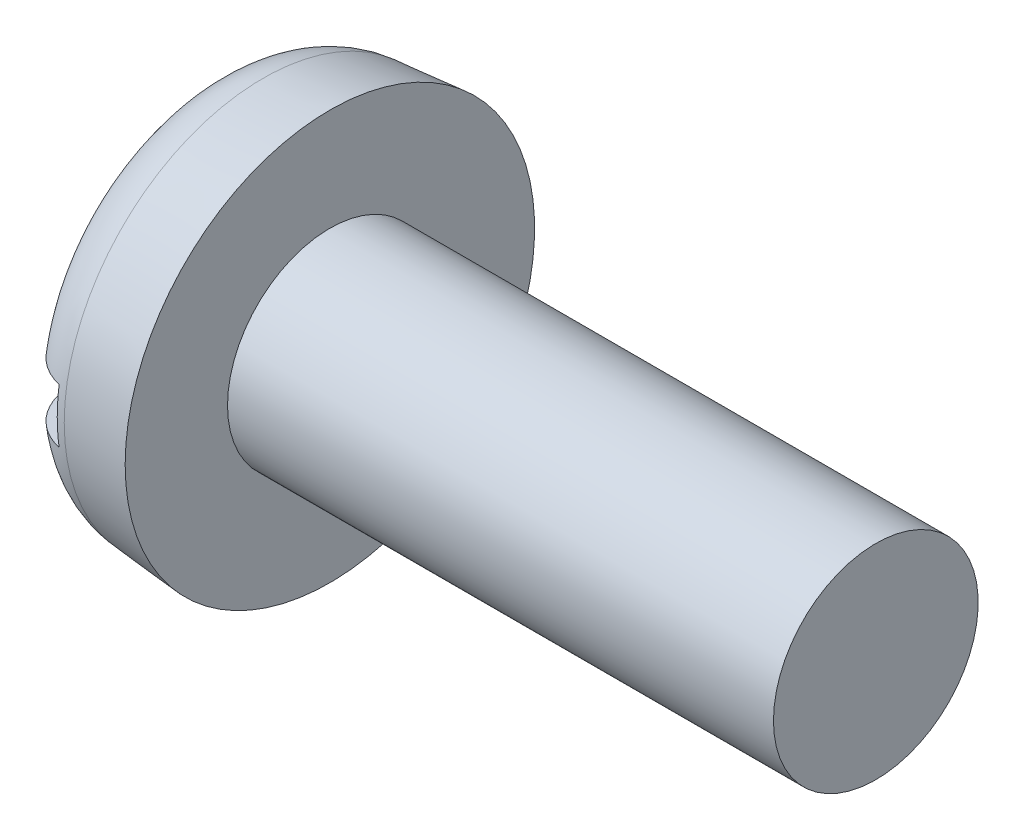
ISO-10303-21;
HEADER;
FILE_DESCRIPTION(('STEP AP214'),'2;1');
FILE_NAME('part.step','',(''),(''),'','','');
FILE_SCHEMA(('AUTOMOTIVE_DESIGN { 1 0 10303 214 1 1 1 1 }'));
ENDSEC;
DATA;
#1=APPLICATION_CONTEXT('core data for automotive mechanical design processes');
#2=APPLICATION_PROTOCOL_DEFINITION('international standard','automotive_design',2000,#1);
#3=PRODUCT_CONTEXT('',#1,'mechanical');
#4=PRODUCT('Part','Part','',(#3));
#5=PRODUCT_RELATED_PRODUCT_CATEGORY('part','',(#4));
#6=PRODUCT_DEFINITION_FORMATION('','',#4);
#7=PRODUCT_DEFINITION_CONTEXT('part definition',#1,'design');
#8=PRODUCT_DEFINITION('design','',#6,#7);
#9=PRODUCT_DEFINITION_SHAPE('','',#8);
#10=(LENGTH_UNIT() NAMED_UNIT(*) SI_UNIT(.MILLI.,.METRE.));
#11=(NAMED_UNIT(*) PLANE_ANGLE_UNIT() SI_UNIT($,.RADIAN.));
#12=(NAMED_UNIT(*) SI_UNIT($,.STERADIAN.) SOLID_ANGLE_UNIT());
#13=UNCERTAINTY_MEASURE_WITH_UNIT(LENGTH_MEASURE(1.E-05),#10,'distance_accuracy_value','');
#14=(GEOMETRIC_REPRESENTATION_CONTEXT(3) GLOBAL_UNCERTAINTY_ASSIGNED_CONTEXT((#13)) GLOBAL_UNIT_ASSIGNED_CONTEXT((#10,
#11,#12)) REPRESENTATION_CONTEXT('',''));
#15=CARTESIAN_POINT('',(0.,0.,0.));
#16=DIRECTION('',(0.,0.,1.));
#17=DIRECTION('',(1.,0.,0.));
#18=AXIS2_PLACEMENT_3D('',#15,#16,#17);
#19=CARTESIAN_POINT('',(0.,0.,0.));
#20=DIRECTION('',(-1.,0.,0.));
#21=DIRECTION('',(0.,0.,1.));
#22=AXIS2_PLACEMENT_3D('',#19,#20,#21);
#23=PLANE('',#22);
#24=DIRECTION('',(0.,0.,-1.));
#25=VECTOR('',#24,1.);
#26=CARTESIAN_POINT('',(0.,0.799999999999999,6.));
#27=LINE('',#26,#25);
#28=CARTESIAN_POINT('',(0.,0.799999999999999,3.9555566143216));
#29=VERTEX_POINT('',#28);
#30=CARTESIAN_POINT('',(0.,0.799999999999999,-3.9555566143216));
#31=VERTEX_POINT('',#30);
#32=EDGE_CURVE('E88',#29,#31,#27,.T.);
#33=ORIENTED_EDGE('',*,*,#32,.F.);
#34=CARTESIAN_POINT('',(0.,0.,0.));
#35=DIRECTION('',(-1.,0.,0.));
#36=DIRECTION('',(0.,0.,1.));
#37=AXIS2_PLACEMENT_3D('',#34,#35,#36);
#38=CIRCLE('',#37,4.03564469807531);
#39=EDGE_CURVE('E94',#29,#31,#38,.T.);
#40=ORIENTED_EDGE('',*,*,#39,.T.);
#41=EDGE_LOOP('',(#33,#40));
#42=FACE_BOUND('',#41,.T.);
#43=ADVANCED_FACE('F35',(#42),#23,.T.);
#44=CARTESIAN_POINT('',(-25.4,0.,0.));
#45=DIRECTION('',(-1.,0.,0.));
#46=DIRECTION('',(0.,0.,1.));
#47=AXIS2_PLACEMENT_3D('',#44,#45,#46);
#48=CYLINDRICAL_SURFACE('',#47,3.);
#49=CARTESIAN_POINT('',(19.6,0.,0.));
#50=DIRECTION('',(-1.,0.,0.));
#51=DIRECTION('',(0.,0.,1.));
#52=AXIS2_PLACEMENT_3D('',#49,#50,#51);
#53=CIRCLE('',#52,3.);
#54=CARTESIAN_POINT('',(19.6,0.,3.));
#55=VERTEX_POINT('',#54);
#56=EDGE_CURVE('E95',#55,#55,#53,.T.);
#57=ORIENTED_EDGE('',*,*,#56,.T.);
#58=EDGE_LOOP('',(#57));
#59=FACE_BOUND('',#58,.T.);
#60=CARTESIAN_POINT('',(3.6,0.,0.));
#61=DIRECTION('',(-1.,0.,0.));
#62=DIRECTION('',(0.,0.,1.));
#63=AXIS2_PLACEMENT_3D('',#60,#61,#62);
#64=CIRCLE('',#63,3.);
#65=CARTESIAN_POINT('',(3.6,0.,3.));
#66=VERTEX_POINT('',#65);
#67=EDGE_CURVE('E152',#66,#66,#64,.T.);
#68=ORIENTED_EDGE('',*,*,#67,.F.);
#69=EDGE_LOOP('',(#68));
#70=FACE_BOUND('',#69,.T.);
#71=ADVANCED_FACE('F140',(#59,#70),#48,.T.);
#72=CARTESIAN_POINT('',(19.6,3.,0.));
#73=DIRECTION('',(1.,0.,0.));
#74=DIRECTION('',(0.,0.,-1.));
#75=AXIS2_PLACEMENT_3D('',#72,#73,#74);
#76=PLANE('',#75);
#77=ORIENTED_EDGE('',*,*,#56,.F.);
#78=EDGE_LOOP('',(#77));
#79=FACE_BOUND('',#78,.T.);
#80=ADVANCED_FACE('F138',(#79),#76,.T.);
#81=DIRECTION('',(0.,0.,1.));
#82=VECTOR('',#81,1.);
#83=CARTESIAN_POINT('',(0.,-0.799999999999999,-6.));
#84=LINE('',#83,#82);
#85=CARTESIAN_POINT('',(0.,-0.799999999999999,-3.9555566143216));
#86=VERTEX_POINT('',#85);
#87=CARTESIAN_POINT('',(0.,-0.800000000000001,3.9555566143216));
#88=VERTEX_POINT('',#87);
#89=EDGE_CURVE('E79',#86,#88,#84,.T.);
#90=ORIENTED_EDGE('',*,*,#89,.F.);
#91=EDGE_CURVE('E86',#86,#88,#38,.T.);
#92=ORIENTED_EDGE('',*,*,#91,.T.);
#93=EDGE_LOOP('',(#90,#92));
#94=FACE_BOUND('',#93,.T.);
#95=ADVANCED_FACE('F85',(#94),#23,.T.);
#96=CARTESIAN_POINT('',(0.,0.,0.));
#97=DIRECTION('',(1.,0.,0.));
#98=DIRECTION('',(0.,0.,-1.));
#99=AXIS2_PLACEMENT_3D('',#96,#97,#98);
#100=CONICAL_SURFACE('',#99,5.68504081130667,0.0872664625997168);
#101=CARTESIAN_POINT('',(1.64311966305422,0.,0.));
#102=DIRECTION('',(-1.,0.,0.));
#103=DIRECTION('',(0.,0.,1.));
#104=AXIS2_PLACEMENT_3D('',#101,#102,#103);
#105=CIRCLE('',#104,5.82879515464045);
#106=CARTESIAN_POINT('',(1.64311966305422,0.,5.82879515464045));
#107=VERTEX_POINT('',#106);
#108=EDGE_CURVE('E98',#107,#107,#105,.F.);
#109=ORIENTED_EDGE('',*,*,#108,.T.);
#110=EDGE_LOOP('',(#109));
#111=FACE_BOUND('',#110,.T.);
#112=CARTESIAN_POINT('',(3.6,0.,0.));
#113=DIRECTION('',(-1.,0.,0.));
#114=DIRECTION('',(0.,0.,1.));
#115=AXIS2_PLACEMENT_3D('',#112,#113,#114);
#116=CIRCLE('',#115,6.);
#117=CARTESIAN_POINT('',(3.6,0.,6.));
#118=VERTEX_POINT('',#117);
#119=EDGE_CURVE('E100',#118,#118,#116,.T.);
#120=ORIENTED_EDGE('',*,*,#119,.T.);
#121=EDGE_LOOP('',(#120));
#122=FACE_BOUND('',#121,.T.);
#123=ADVANCED_FACE('F131',(#111,#122),#100,.T.);
#124=CARTESIAN_POINT('',(3.6,3.,0.));
#125=DIRECTION('',(-1.,0.,0.));
#126=DIRECTION('',(0.,0.,1.));
#127=AXIS2_PLACEMENT_3D('',#124,#125,#126);
#128=PLANE('',#127);
#129=ORIENTED_EDGE('',*,*,#119,.F.);
#130=EDGE_LOOP('',(#129));
#131=FACE_BOUND('',#130,.T.);
#132=ORIENTED_EDGE('',*,*,#67,.T.);
#133=EDGE_LOOP('',(#132));
#134=FACE_BOUND('',#133,.T.);
#135=ADVANCED_FACE('F127',(#131,#134),#128,.F.);
#136=CARTESIAN_POINT('',(1.8,0.,0.));
#137=DIRECTION('',(-1.,0.,0.));
#138=DIRECTION('',(0.,0.,1.));
#139=AXIS2_PLACEMENT_3D('',#136,#137,#138);
#140=TOROIDAL_SURFACE('',#139,4.03564469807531,1.8);
#141=CARTESIAN_POINT('',(0.540762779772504,0.799999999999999,-5.2613759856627));
#142=CARTESIAN_POINT('',(0.612348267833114,0.799999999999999,-5.33226007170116));
#143=CARTESIAN_POINT('',(0.689931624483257,0.799999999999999,-5.3971854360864));
#144=CARTESIAN_POINT('',(0.854947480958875,0.799999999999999,-5.51316161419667));
#145=CARTESIAN_POINT('',(0.94239068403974,0.799999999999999,-5.56419714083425));
#146=CARTESIAN_POINT('',(1.12461220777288,0.799999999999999,-5.650821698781));
#147=CARTESIAN_POINT('',(1.21938917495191,0.799999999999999,-5.6864135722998));
#148=CARTESIAN_POINT('',(1.41356630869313,0.799999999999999,-5.74109194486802));
#149=CARTESIAN_POINT('',(1.51296538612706,0.799999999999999,-5.76018231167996));
#150=CARTESIAN_POINT('',(1.71313899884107,0.799999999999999,-5.78126121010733));
#151=CARTESIAN_POINT('',(1.81390602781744,0.799999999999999,-5.78332104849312));
#152=CARTESIAN_POINT('',(2.01435310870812,0.799999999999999,-5.77046455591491));
#153=CARTESIAN_POINT('',(2.11403314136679,0.799999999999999,-5.75554792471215));
#154=CARTESIAN_POINT('',(2.309314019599,0.799999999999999,-5.70921606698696));
#155=CARTESIAN_POINT('',(2.40492104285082,0.799999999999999,-5.67782686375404));
#156=CARTESIAN_POINT('',(2.58952927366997,0.799999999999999,-5.59948776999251));
#157=CARTESIAN_POINT('',(2.67853045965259,0.799999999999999,-5.55253782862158));
#158=CARTESIAN_POINT('',(2.84769451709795,0.799999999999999,-5.44428887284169));
#159=CARTESIAN_POINT('',(2.92783091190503,0.799999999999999,-5.38294849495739));
#160=CARTESIAN_POINT('',(3.07676159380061,0.799999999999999,-5.24777626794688));
#161=CARTESIAN_POINT('',(3.1455556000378,0.799999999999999,-5.17394410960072));
#162=CARTESIAN_POINT('',(3.27042510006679,0.799999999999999,-5.01531035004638));
#163=CARTESIAN_POINT('',(3.32640120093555,0.799999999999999,-4.93043053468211));
#164=CARTESIAN_POINT('',(3.4235057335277,0.799999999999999,-4.75256933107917));
#165=CARTESIAN_POINT('',(3.46463341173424,0.799999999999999,-4.65958753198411));
#166=CARTESIAN_POINT('',(3.53144158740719,0.799999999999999,-4.46694835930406));
#167=CARTESIAN_POINT('',(3.55692557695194,0.799999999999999,-4.36722286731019));
#168=CARTESIAN_POINT('',(3.59108701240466,0.799999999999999,-4.16493761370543));
#169=CARTESIAN_POINT('',(3.59976314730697,0.799999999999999,-4.06237763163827));
#170=CARTESIAN_POINT('',(3.60023112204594,0.799999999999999,-3.85550711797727));
#171=CARTESIAN_POINT('',(3.59173848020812,0.799999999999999,-3.75119596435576));
#172=CARTESIAN_POINT('',(3.55768438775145,0.799999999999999,-3.54539907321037));
#173=CARTESIAN_POINT('',(3.53212117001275,0.799999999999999,-3.44391362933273));
#174=CARTESIAN_POINT('',(3.46412322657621,0.799999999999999,-3.24471369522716));
#175=CARTESIAN_POINT('',(3.42139292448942,0.799999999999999,-3.14710004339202));
#176=CARTESIAN_POINT('',(3.32030286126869,0.799999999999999,-2.96031799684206));
#177=CARTESIAN_POINT('',(3.26194098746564,0.799999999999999,-2.87115074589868));
#178=CARTESIAN_POINT('',(3.13053846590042,0.799999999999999,-2.70303664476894));
#179=CARTESIAN_POINT('',(3.05736818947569,0.799999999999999,-2.62419095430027));
#180=CARTESIAN_POINT('',(2.89859048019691,0.799999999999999,-2.48017518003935));
#181=CARTESIAN_POINT('',(2.81298317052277,0.799999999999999,-2.41500496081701));
#182=CARTESIAN_POINT('',(2.6334271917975,0.799999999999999,-2.30187272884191));
#183=CARTESIAN_POINT('',(2.53967929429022,0.799999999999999,-2.25359299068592));
#184=CARTESIAN_POINT('',(2.34507363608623,0.799999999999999,-2.17455467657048));
#185=CARTESIAN_POINT('',(2.24421969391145,0.799999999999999,-2.14378676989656));
#186=CARTESIAN_POINT('',(2.04443930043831,0.799999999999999,-2.10254396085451));
#187=CARTESIAN_POINT('',(1.94573097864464,0.799999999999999,-2.09101175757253));
#188=CARTESIAN_POINT('',(1.74783816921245,0.799999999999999,-2.08550669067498));
#189=CARTESIAN_POINT('',(1.64865381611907,0.799999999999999,-2.09152912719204));
#190=CARTESIAN_POINT('',(1.45702700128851,0.799999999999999,-2.12018138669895));
#191=CARTESIAN_POINT('',(1.36447664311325,0.799999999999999,-2.14209986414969));
#192=CARTESIAN_POINT('',(1.18420660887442,0.799999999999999,-2.20075771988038));
#193=CARTESIAN_POINT('',(1.09648771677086,0.799999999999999,-2.23749949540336));
#194=CARTESIAN_POINT('',(0.925723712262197,0.799999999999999,-2.32557805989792));
#195=CARTESIAN_POINT('',(0.842868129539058,0.799999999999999,-2.37728131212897));
#196=CARTESIAN_POINT('',(0.686362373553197,0.799999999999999,-2.493116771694));
#197=CARTESIAN_POINT('',(0.612714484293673,0.799999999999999,-2.55725205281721));
#198=CARTESIAN_POINT('',(0.472161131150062,0.799999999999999,-2.70027682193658));
#199=CARTESIAN_POINT('',(0.405916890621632,0.799999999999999,-2.77981681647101));
#200=CARTESIAN_POINT('',(0.287173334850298,0.799999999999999,-2.9485732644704));
#201=CARTESIAN_POINT('',(0.234676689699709,0.799999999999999,-3.03779159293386));
#202=CARTESIAN_POINT('',(0.143214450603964,0.799999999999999,-3.22677844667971));
#203=CARTESIAN_POINT('',(0.104782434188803,0.799999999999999,-3.32680584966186));
#204=CARTESIAN_POINT('',(0.0452446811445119,0.799999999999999,-3.5318922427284));
#205=CARTESIAN_POINT('',(0.0241387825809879,0.799999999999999,-3.63695118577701));
#206=CARTESIAN_POINT('',(-1.12670491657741E-05,0.799999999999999,-3.84916824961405));
#207=CARTESIAN_POINT('',(-0.00304965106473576,0.799999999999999,-3.95632702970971));
#208=CARTESIAN_POINT('',(0.00921984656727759,0.799999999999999,-4.16962319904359));
#209=CARTESIAN_POINT('',(0.0245310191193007,0.799999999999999,-4.27576040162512));
#210=CARTESIAN_POINT('',(0.0728327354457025,0.799999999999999,-4.48216521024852));
#211=CARTESIAN_POINT('',(0.105541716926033,0.799999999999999,-4.58249883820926));
#212=CARTESIAN_POINT('',(0.187634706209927,0.799999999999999,-4.77599767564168));
#213=CARTESIAN_POINT('',(0.236996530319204,0.799999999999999,-4.86917222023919));
#214=CARTESIAN_POINT('',(0.329466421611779,0.799999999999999,-5.01228034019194));
#215=CARTESIAN_POINT('',(0.367921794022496,0.799999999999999,-5.06527765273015));
#216=CARTESIAN_POINT('',(0.450329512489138,0.799999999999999,-5.16681267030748));
#217=CARTESIAN_POINT('',(0.494281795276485,0.799999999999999,-5.21535042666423));
#218=CARTESIAN_POINT('',(0.540762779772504,0.799999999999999,-5.2613759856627));
#219=B_SPLINE_CURVE_WITH_KNOTS('',3,(#141,#142,#143,#144,#145,#146,#147,#148,#149,#150,#151,
#152,#153,#154,#155,#156,#157,#158,#159,#160,#161,#162,#163,#164,#165,#166,#167,#168,#169,#170,
#171,#172,#173,#174,#175,#176,#177,#178,#179,#180,#181,#182,#183,#184,#185,#186,#187,#188,#189,
#190,#191,#192,#193,#194,#195,#196,#197,#198,#199,#200,#201,#202,#203,#204,#205,#206,#207,#208,
#209,#210,#211,#212,#213,#214,#215,#216,#217,#218),.UNSPECIFIED.,.T.,.F.,(4,2,2,2,2,2,2,2,2,2,2,
2,2,2,2,2,2,2,2,2,2,2,2,2,2,2,2,2,2,2,2,2,2,2,2,2,2,2,4),(0.,0.301990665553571,
0.604312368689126,0.906578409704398,1.20877358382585,1.50970282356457,1.81063738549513,
2.11109795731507,2.41155951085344,2.71289551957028,3.01423898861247,3.31784547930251,
3.6214673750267,3.92882908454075,4.23621476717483,4.54873547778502,4.86128854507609,
5.17947093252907,5.49769634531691,5.81883829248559,6.13997705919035,6.45470120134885,
6.76925749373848,7.06587349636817,7.36241009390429,7.64643650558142,7.93050886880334,
8.22223277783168,8.51402890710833,8.8231740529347,9.13237919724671,9.45232886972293,
9.77227555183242,10.0923243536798,10.4124305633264,10.7275071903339,11.042165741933,
11.2382527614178,11.4343375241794),.UNSPECIFIED.);
#220=CARTESIAN_POINT('',(1.4,0.799999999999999,-5.73510972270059));
#221=VERTEX_POINT('',#220);
#222=EDGE_CURVE('E11',#31,#221,#219,.T.);
#223=ORIENTED_EDGE('',*,*,#222,.F.);
#224=ORIENTED_EDGE('',*,*,#39,.F.);
#225=CARTESIAN_POINT('',(0.836266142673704,0.799999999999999,2.3847675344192));
#226=CARTESIAN_POINT('',(0.917616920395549,0.799999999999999,2.33037611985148));
#227=CARTESIAN_POINT('',(1.00338812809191,0.799999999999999,2.28250940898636));
#228=CARTESIAN_POINT('',(1.18171371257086,0.799999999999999,2.20157945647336));
#229=CARTESIAN_POINT('',(1.27427138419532,0.799999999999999,2.16852346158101));
#230=CARTESIAN_POINT('',(1.46387360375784,0.799999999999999,2.11861651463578));
#231=CARTESIAN_POINT('',(1.56092620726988,0.799999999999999,2.10179593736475));
#232=CARTESIAN_POINT('',(1.75645828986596,0.799999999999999,2.08531619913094));
#233=CARTESIAN_POINT('',(1.85493729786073,0.799999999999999,2.08565149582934));
#234=CARTESIAN_POINT('',(2.04724581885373,0.799999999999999,2.10316628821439));
#235=CARTESIAN_POINT('',(2.1411242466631,0.799999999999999,2.11981673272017));
#236=CARTESIAN_POINT('',(2.32483197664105,0.799999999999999,2.16840533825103));
#237=CARTESIAN_POINT('',(2.41466058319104,0.799999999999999,2.20034611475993));
#238=CARTESIAN_POINT('',(2.58937479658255,0.799999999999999,2.27883470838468));
#239=CARTESIAN_POINT('',(2.67416016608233,0.799999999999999,2.32560484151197));
#240=CARTESIAN_POINT('',(2.83527159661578,0.799999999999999,2.43194790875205));
#241=CARTESIAN_POINT('',(2.91159566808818,0.799999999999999,2.4915238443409));
#242=CARTESIAN_POINT('',(3.05833847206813,0.799999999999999,2.62557742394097));
#243=CARTESIAN_POINT('',(3.12814463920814,0.799999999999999,2.70072607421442));
#244=CARTESIAN_POINT('',(3.25476371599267,0.799999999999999,2.86127427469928));
#245=CARTESIAN_POINT('',(3.31157384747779,0.799999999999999,2.94667601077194));
#246=CARTESIAN_POINT('',(3.41282909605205,0.799999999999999,3.12914373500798));
#247=CARTESIAN_POINT('',(3.4566732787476,0.799999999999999,3.22654397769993));
#248=CARTESIAN_POINT('',(3.52749042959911,0.799999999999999,3.42730182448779));
#249=CARTESIAN_POINT('',(3.55446245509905,0.799999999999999,3.53065976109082));
#250=CARTESIAN_POINT('',(3.59074777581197,0.799999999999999,3.74099682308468));
#251=CARTESIAN_POINT('',(3.59996828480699,0.799999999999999,3.84799201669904));
#252=CARTESIAN_POINT('',(3.60003154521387,0.799999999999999,4.06199242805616));
#253=CARTESIAN_POINT('',(3.59087543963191,0.799999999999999,4.16899764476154));
#254=CARTESIAN_POINT('',(3.5545508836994,0.799999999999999,4.37828946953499));
#255=CARTESIAN_POINT('',(3.5276490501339,0.799999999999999,4.48062230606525));
#256=CARTESIAN_POINT('',(3.45672417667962,0.799999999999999,4.67917518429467));
#257=CARTESIAN_POINT('',(3.41270279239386,0.799999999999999,4.77539581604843));
#258=CARTESIAN_POINT('',(3.30967441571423,0.799999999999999,4.95711293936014));
#259=CARTESIAN_POINT('',(3.2509575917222,0.799999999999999,5.04277397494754));
#260=CARTESIAN_POINT('',(3.11977209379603,0.799999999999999,5.20282644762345));
#261=CARTESIAN_POINT('',(3.04730458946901,0.799999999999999,5.27721884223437));
#262=CARTESIAN_POINT('',(2.89186263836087,0.799999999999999,5.41145672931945));
#263=CARTESIAN_POINT('',(2.80906226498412,0.799999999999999,5.47150384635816));
#264=CARTESIAN_POINT('',(2.63447307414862,0.799999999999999,5.57667826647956));
#265=CARTESIAN_POINT('',(2.54268479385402,0.799999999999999,5.62180646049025));
#266=CARTESIAN_POINT('',(2.35372245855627,0.799999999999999,5.69541178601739));
#267=CARTESIAN_POINT('',(2.25661170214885,0.799999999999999,5.72405148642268));
#268=CARTESIAN_POINT('',(2.05894963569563,0.799999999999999,5.76452632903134));
#269=CARTESIAN_POINT('',(1.95839844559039,0.799999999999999,5.77636205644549));
#270=CARTESIAN_POINT('',(1.75726466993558,0.799999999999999,5.78286013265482));
#271=CARTESIAN_POINT('',(1.65668492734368,0.799999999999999,5.77761084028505));
#272=CARTESIAN_POINT('',(1.45783846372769,0.799999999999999,5.75028865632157));
#273=CARTESIAN_POINT('',(1.35957171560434,0.799999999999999,5.72821596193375));
#274=CARTESIAN_POINT('',(1.16819371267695,0.799999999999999,5.66791633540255));
#275=CARTESIAN_POINT('',(1.07507939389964,0.799999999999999,5.62969912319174));
#276=CARTESIAN_POINT('',(0.896555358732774,0.799999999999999,5.53823241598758));
#277=CARTESIAN_POINT('',(0.811145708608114,0.799999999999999,5.4849827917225));
#278=CARTESIAN_POINT('',(0.650082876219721,0.799999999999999,5.36476593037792));
#279=CARTESIAN_POINT('',(0.574468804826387,0.799999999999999,5.29774630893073));
#280=CARTESIAN_POINT('',(0.435451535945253,0.799999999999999,5.15205983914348));
#281=CARTESIAN_POINT('',(0.372048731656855,0.799999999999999,5.07339261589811));
#282=CARTESIAN_POINT('',(0.258650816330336,0.799999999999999,4.90594446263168));
#283=CARTESIAN_POINT('',(0.208774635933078,0.799999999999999,4.81708301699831));
#284=CARTESIAN_POINT('',(0.124428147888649,0.799999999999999,4.63233098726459));
#285=CARTESIAN_POINT('',(0.0899587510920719,0.799999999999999,4.53643998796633));
#286=CARTESIAN_POINT('',(0.0368868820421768,0.799999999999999,4.33899079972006));
#287=CARTESIAN_POINT('',(0.0185025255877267,0.799999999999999,4.23737401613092));
#288=CARTESIAN_POINT('',(-0.00125734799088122,0.799999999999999,4.03250747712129));
#289=CARTESIAN_POINT('',(-0.00263209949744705,0.799999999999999,3.9292576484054));
#290=CARTESIAN_POINT('',(0.0116307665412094,0.799999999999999,3.72214563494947));
#291=CARTESIAN_POINT('',(0.0275632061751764,0.799999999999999,3.61830377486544));
#292=CARTESIAN_POINT('',(0.0763335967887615,0.799999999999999,3.41464106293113));
#293=CARTESIAN_POINT('',(0.10917724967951,0.799999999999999,3.31482157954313));
#294=CARTESIAN_POINT('',(0.191511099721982,0.799999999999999,3.12021092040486));
#295=CARTESIAN_POINT('',(0.241286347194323,0.799999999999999,3.02554040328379));
#296=CARTESIAN_POINT('',(0.355915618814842,0.799999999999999,2.8458978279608));
#297=CARTESIAN_POINT('',(0.420755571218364,0.799999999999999,2.76091682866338));
#298=CARTESIAN_POINT('',(0.543269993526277,0.799999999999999,2.62572980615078));
#299=CARTESIAN_POINT('',(0.597683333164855,0.799999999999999,2.57253239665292));
#300=CARTESIAN_POINT('',(0.712598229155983,0.799999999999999,2.4731680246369));
#301=CARTESIAN_POINT('',(0.773099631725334,0.799999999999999,2.42700088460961));
#302=CARTESIAN_POINT('',(0.836266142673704,0.799999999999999,2.3847675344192));
#303=B_SPLINE_CURVE_WITH_KNOTS('',3,(#225,#226,#227,#228,#229,#230,#231,#232,#233,#234,#235,
#236,#237,#238,#239,#240,#241,#242,#243,#244,#245,#246,#247,#248,#249,#250,#251,#252,#253,#254,
#255,#256,#257,#258,#259,#260,#261,#262,#263,#264,#265,#266,#267,#268,#269,#270,#271,#272,#273,
#274,#275,#276,#277,#278,#279,#280,#281,#282,#283,#284,#285,#286,#287,#288,#289,#290,#291,#292,
#293,#294,#295,#296,#297,#298,#299,#300,#301,#302),.UNSPECIFIED.,.T.,.F.,(4,2,2,2,2,2,2,2,2,2,2,
2,2,2,2,2,2,2,2,2,2,2,2,2,2,2,2,2,2,2,2,2,2,2,2,2,2,2,4),(0.,0.293321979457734,
0.586787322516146,0.880800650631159,1.17471899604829,1.45941156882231,1.74415285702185,
2.03338255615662,2.32268012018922,2.62901646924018,2.93541824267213,3.25435495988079,
3.57330949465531,3.89392670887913,4.21452398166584,4.53041098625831,4.84626744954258,
5.1563211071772,5.46634840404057,5.77172128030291,6.0770759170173,6.37936593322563,
6.6816454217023,6.98236409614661,7.2830792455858,7.5836136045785,7.88415054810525,
8.18585270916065,8.48756458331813,8.79184901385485,9.09615143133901,9.40451898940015,
9.71290042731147,10.0266186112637,10.3404426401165,10.6598354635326,10.9789311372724,
11.2066928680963,11.43444884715),.UNSPECIFIED.);
#304=CARTESIAN_POINT('',(1.4,0.799999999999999,5.73510972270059));
#305=VERTEX_POINT('',#304);
#306=EDGE_CURVE('E112',#305,#29,#303,.T.);
#307=ORIENTED_EDGE('',*,*,#306,.F.);
#308=CARTESIAN_POINT('',(1.4,0.,0.));
#309=DIRECTION('',(-1.,0.,0.));
#310=DIRECTION('',(0.,0.,1.));
#311=AXIS2_PLACEMENT_3D('',#308,#309,#310);
#312=CIRCLE('',#311,5.79063757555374);
#313=CARTESIAN_POINT('',(1.4,-0.800000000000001,5.73510972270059));
#314=VERTEX_POINT('',#313);
#315=EDGE_CURVE('E106',#305,#314,#312,.F.);
#316=ORIENTED_EDGE('',*,*,#315,.T.);
#317=CARTESIAN_POINT('',(0.836266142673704,-0.8,2.3847675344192));
#318=CARTESIAN_POINT('',(0.748506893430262,-0.8,2.44345191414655));
#319=CARTESIAN_POINT('',(0.665766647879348,-0.8,2.50981960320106));
#320=CARTESIAN_POINT('',(0.512551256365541,-0.8,2.65561376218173));
#321=CARTESIAN_POINT('',(0.442099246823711,-0.8,2.73506432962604));
#322=CARTESIAN_POINT('',(0.315475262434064,-0.8,2.90443495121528));
#323=CARTESIAN_POINT('',(0.259280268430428,-0.8,2.99433778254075));
#324=CARTESIAN_POINT('',(0.162548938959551,-0.8,3.18215299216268));
#325=CARTESIAN_POINT('',(0.122006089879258,-0.8,3.28006201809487));
#326=CARTESIAN_POINT('',(0.0572425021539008,-0.8,3.4827212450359));
#327=CARTESIAN_POINT('',(0.0332676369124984,-0.8,3.58755021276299));
#328=CARTESIAN_POINT('',(0.00342578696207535,-0.8,3.79976969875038));
#329=CARTESIAN_POINT('',(-0.00244009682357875,-0.800000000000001,3.90716037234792));
#330=CARTESIAN_POINT('',(0.00425089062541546,-0.800000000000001,4.12040369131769));
#331=CARTESIAN_POINT('',(0.0166422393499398,-0.800000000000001,4.22626147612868));
#332=CARTESIAN_POINT('',(0.0593599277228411,-0.800000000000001,4.43429705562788));
#333=CARTESIAN_POINT('',(0.0896844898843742,-0.800000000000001,4.53647521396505));
#334=CARTESIAN_POINT('',(0.166811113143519,-0.800000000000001,4.73226366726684));
#335=CARTESIAN_POINT('',(0.21330327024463,-0.800000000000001,4.82599604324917));
#336=CARTESIAN_POINT('',(0.32162267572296,-0.800000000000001,5.00413844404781));
#337=CARTESIAN_POINT('',(0.383448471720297,-0.800000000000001,5.08854935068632));
#338=CARTESIAN_POINT('',(0.519544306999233,-0.800000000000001,5.24416143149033));
#339=CARTESIAN_POINT('',(0.593588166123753,-0.800000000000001,5.31556046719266));
#340=CARTESIAN_POINT('',(0.752739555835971,-0.800000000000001,5.44472836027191));
#341=CARTESIAN_POINT('',(0.837846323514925,-0.800000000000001,5.5024981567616));
#342=CARTESIAN_POINT('',(1.01558854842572,-0.800000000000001,5.60205300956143));
#343=CARTESIAN_POINT('',(1.10812041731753,-0.800000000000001,5.64402306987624));
#344=CARTESIAN_POINT('',(1.29895009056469,-0.800000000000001,5.71170590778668));
#345=CARTESIAN_POINT('',(1.39724763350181,-0.800000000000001,5.7374194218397));
#346=CARTESIAN_POINT('',(1.59606633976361,-0.800000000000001,5.77169733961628));
#347=CARTESIAN_POINT('',(1.69656671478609,-0.800000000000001,5.78038241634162));
#348=CARTESIAN_POINT('',(1.89759433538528,-0.800000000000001,5.78071120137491));
#349=CARTESIAN_POINT('',(1.99812158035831,-0.800000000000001,5.77235526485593));
#350=CARTESIAN_POINT('',(2.19609344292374,-0.800000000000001,5.73889133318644));
#351=CARTESIAN_POINT('',(2.29354498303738,-0.800000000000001,5.71382425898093));
#352=CARTESIAN_POINT('',(2.48286854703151,-0.800000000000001,5.64771711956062));
#353=CARTESIAN_POINT('',(2.57474056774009,-0.800000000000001,5.60667704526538));
#354=CARTESIAN_POINT('',(2.75051258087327,-0.800000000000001,5.50972539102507));
#355=CARTESIAN_POINT('',(2.8343959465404,-0.800000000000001,5.45378367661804));
#356=CARTESIAN_POINT('',(2.99165678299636,-0.800000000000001,5.32869697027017));
#357=CARTESIAN_POINT('',(3.06503402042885,-0.800000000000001,5.25955168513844));
#358=CARTESIAN_POINT('',(3.19973989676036,-0.800000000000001,5.10955333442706));
#359=CARTESIAN_POINT('',(3.26098586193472,-0.800000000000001,5.02862604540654));
#360=CARTESIAN_POINT('',(3.36919753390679,-0.800000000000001,4.85773374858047));
#361=CARTESIAN_POINT('',(3.41616259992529,-0.800000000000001,4.76776833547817));
#362=CARTESIAN_POINT('',(3.49507738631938,-0.800000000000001,4.5802716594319));
#363=CARTESIAN_POINT('',(3.52685014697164,-0.800000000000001,4.48266594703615));
#364=CARTESIAN_POINT('',(3.57383908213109,-0.800000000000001,4.28355151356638));
#365=CARTESIAN_POINT('',(3.58905405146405,-0.800000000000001,4.18204250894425));
#366=CARTESIAN_POINT('',(3.60277332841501,-0.800000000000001,3.97627512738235));
#367=CARTESIAN_POINT('',(3.60100695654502,-0.8,3.87199872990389));
#368=CARTESIAN_POINT('',(3.58032198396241,-0.8,3.66516328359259));
#369=CARTESIAN_POINT('',(3.56140169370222,-0.8,3.56260440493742));
#370=CARTESIAN_POINT('',(3.50655445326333,-0.8,3.3601262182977));
#371=CARTESIAN_POINT('',(3.47032341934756,-0.8,3.26028924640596));
#372=CARTESIAN_POINT('',(3.38182060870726,-0.8,3.06798854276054));
#373=CARTESIAN_POINT('',(3.32954675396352,-0.8,2.97552576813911));
#374=CARTESIAN_POINT('',(3.20964725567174,-0.8,2.79948120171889));
#375=CARTESIAN_POINT('',(3.14184223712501,-0.8,2.71602141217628));
#376=CARTESIAN_POINT('',(2.99302219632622,-0.8,2.56181483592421));
#377=CARTESIAN_POINT('',(2.91200632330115,-0.8,2.49106886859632));
#378=CARTESIAN_POINT('',(2.73997760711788,-0.8,2.36551639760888));
#379=CARTESIAN_POINT('',(2.64910309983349,-0.8,2.31052086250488));
#380=CARTESIAN_POINT('',(2.4590409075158,-0.8,2.21753014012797));
#381=CARTESIAN_POINT('',(2.35985743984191,-0.8,2.17952638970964));
#382=CARTESIAN_POINT('',(2.16147923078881,-0.8,2.12383562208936));
#383=CARTESIAN_POINT('',(2.06255196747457,-0.8,2.10519696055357));
#384=CARTESIAN_POINT('',(1.86294330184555,-0.8,2.08580594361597));
#385=CARTESIAN_POINT('',(1.76226208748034,-0.8,2.08505168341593));
#386=CARTESIAN_POINT('',(1.56749167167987,-0.8,2.1010369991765));
#387=CARTESIAN_POINT('',(1.47332742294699,-0.8,2.11688981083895));
#388=CARTESIAN_POINT('',(1.28901868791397,-0.8,2.16397488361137));
#389=CARTESIAN_POINT('',(1.19886974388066,-0.8,2.19518960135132));
#390=CARTESIAN_POINT('',(1.0638315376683,-0.8,2.25452352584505));
#391=CARTESIAN_POINT('',(1.01673933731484,-0.8,2.27777851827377));
#392=CARTESIAN_POINT('',(0.924773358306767,-0.8,2.32831196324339));
#393=CARTESIAN_POINT('',(0.879899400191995,-0.8,2.35559008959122));
#394=CARTESIAN_POINT('',(0.836266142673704,-0.8,2.3847675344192));
#395=B_SPLINE_CURVE_WITH_KNOTS('',3,(#317,#318,#319,#320,#321,#322,#323,#324,#325,#326,#327,
#328,#329,#330,#331,#332,#333,#334,#335,#336,#337,#338,#339,#340,#341,#342,#343,#344,#345,#346,
#347,#348,#349,#350,#351,#352,#353,#354,#355,#356,#357,#358,#359,#360,#361,#362,#363,#364,#365,
#366,#367,#368,#369,#370,#371,#372,#373,#374,#375,#376,#377,#378,#379,#380,#381,#382,#383,#384,
#385,#386,#387,#388,#389,#390,#391,#392,#393,#394),.UNSPECIFIED.,.T.,.F.,(4,2,2,2,2,2,2,2,2,2,2,
2,2,2,2,2,2,2,2,2,2,2,2,2,2,2,2,2,2,2,2,2,2,2,2,2,2,2,4),(0.,0.316518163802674,
0.633625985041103,0.950218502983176,1.2666791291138,1.58774070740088,1.90882180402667,
2.22700979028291,2.54516624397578,2.8575328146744,3.16986980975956,3.47696670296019,
3.78404242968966,4.08740155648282,4.39074693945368,4.69193476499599,4.99311631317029,
5.29356304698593,5.59400995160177,5.89506910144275,6.19613493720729,6.49918680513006,
6.80225226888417,7.10876667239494,7.41530338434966,7.72673423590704,8.03819576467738,
8.35534173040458,8.6725287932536,8.99358246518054,9.31465682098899,9.63169865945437,
9.94858054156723,10.2490245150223,10.549436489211,10.8345871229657,11.1194128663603,
11.276796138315,11.4341666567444),.UNSPECIFIED.);
#396=EDGE_CURVE('E93',#88,#314,#395,.T.);
#397=ORIENTED_EDGE('',*,*,#396,.F.);
#398=ORIENTED_EDGE('',*,*,#91,.F.);
#399=CARTESIAN_POINT('',(0.540762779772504,-0.799999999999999,-5.2613759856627));
#400=CARTESIAN_POINT('',(0.46800256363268,-0.799999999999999,-5.18931554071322));
#401=CARTESIAN_POINT('',(0.401331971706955,-0.799999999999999,-5.11098969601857));
#402=CARTESIAN_POINT('',(0.282092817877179,-0.799999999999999,-4.94415021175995));
#403=CARTESIAN_POINT('',(0.229543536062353,-0.799999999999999,-4.85562287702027));
#404=CARTESIAN_POINT('',(0.140058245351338,-0.799999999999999,-4.67111833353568));
#405=CARTESIAN_POINT('',(0.103104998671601,-0.799999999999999,-4.57514948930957));
#406=CARTESIAN_POINT('',(0.0456444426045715,-0.799999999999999,-4.37844736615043));
#407=CARTESIAN_POINT('',(0.0251330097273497,-0.799999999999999,-4.27771528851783));
#408=CARTESIAN_POINT('',(0.000807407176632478,-0.799999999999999,-4.07306902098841));
#409=CARTESIAN_POINT('',(-0.00280970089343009,-0.799999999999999,-3.96913144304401));
#410=CARTESIAN_POINT('',(0.00712688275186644,-0.799999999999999,-3.76207815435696));
#411=CARTESIAN_POINT('',(0.0206829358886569,-0.8,-3.65896255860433));
#412=CARTESIAN_POINT('',(0.0648595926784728,-0.8,-3.45448287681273));
#413=CARTESIAN_POINT('',(0.0957869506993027,-0.8,-3.35318504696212));
#414=CARTESIAN_POINT('',(0.173966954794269,-0.8,-3.15709227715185));
#415=CARTESIAN_POINT('',(0.221221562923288,-0.8,-3.06229812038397));
#416=CARTESIAN_POINT('',(0.331523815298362,-0.8,-2.8805427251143));
#417=CARTESIAN_POINT('',(0.394784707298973,-0.8,-2.79371074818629));
#418=CARTESIAN_POINT('',(0.535080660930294,-0.8,-2.63196239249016));
#419=CARTESIAN_POINT('',(0.612117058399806,-0.8,-2.5570471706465));
#420=CARTESIAN_POINT('',(0.777363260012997,-0.8,-2.42207446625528));
#421=CARTESIAN_POINT('',(0.865488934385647,-0.8,-2.36191424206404));
#422=CARTESIAN_POINT('',(1.05097305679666,-0.8,-2.25807126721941));
#423=CARTESIAN_POINT('',(1.1483280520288,-0.8,-2.21438238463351));
#424=CARTESIAN_POINT('',(1.34472607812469,-0.8,-2.14709500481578));
#425=CARTESIAN_POINT('',(1.44348146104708,-0.8,-2.12265879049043));
#426=CARTESIAN_POINT('',(1.64375523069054,-0.8,-2.09184121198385));
#427=CARTESIAN_POINT('',(1.74527230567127,-0.8,-2.08545142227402));
#428=CARTESIAN_POINT('',(1.94205144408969,-0.8,-2.09089422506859));
#429=CARTESIAN_POINT('',(2.03734311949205,-0.8,-2.1017185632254));
#430=CARTESIAN_POINT('',(2.22475371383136,-0.8,-2.1391955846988));
#431=CARTESIAN_POINT('',(2.31687240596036,-0.8,-2.16584939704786));
#432=CARTESIAN_POINT('',(2.49568716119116,-0.8,-2.23389898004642));
#433=CARTESIAN_POINT('',(2.58237134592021,-0.8,-2.27532580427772));
#434=CARTESIAN_POINT('',(2.74807422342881,-0.8,-2.37138684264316));
#435=CARTESIAN_POINT('',(2.82709115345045,-0.8,-2.42602408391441));
#436=CARTESIAN_POINT('',(2.9799165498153,-0.8,-2.55022645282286));
#437=CARTESIAN_POINT('',(3.05318434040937,-0.8,-2.6204569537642));
#438=CARTESIAN_POINT('',(3.18755425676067,-0.8,-2.77172635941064));
#439=CARTESIAN_POINT('',(3.24865355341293,-0.8,-2.85276777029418));
#440=CARTESIAN_POINT('',(3.35979277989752,-0.8,-3.02754470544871));
#441=CARTESIAN_POINT('',(3.40917690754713,-0.8,-3.1216981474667));
#442=CARTESIAN_POINT('',(3.49164209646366,-0.8,-3.31689856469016));
#443=CARTESIAN_POINT('',(3.52472176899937,-0.8,-3.41794612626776));
#444=CARTESIAN_POINT('',(3.57383047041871,-0.8,-3.62528781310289));
#445=CARTESIAN_POINT('',(3.58966846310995,-0.8,-3.73162733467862));
#446=CARTESIAN_POINT('',(3.60302482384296,-0.8,-3.94545563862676));
#447=CARTESIAN_POINT('',(3.60054405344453,-0.799999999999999,-4.05294436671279));
#448=CARTESIAN_POINT('',(3.57730809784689,-0.799999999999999,-4.26456838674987));
#449=CARTESIAN_POINT('',(3.5567824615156,-0.799999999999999,-4.36872882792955));
#450=CARTESIAN_POINT('',(3.49820144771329,-0.799999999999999,-4.57200098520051));
#451=CARTESIAN_POINT('',(3.46014775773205,-0.799999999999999,-4.67111318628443));
#452=CARTESIAN_POINT('',(3.36835841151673,-0.799999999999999,-4.85952398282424));
#453=CARTESIAN_POINT('',(3.31492535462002,-0.799999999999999,-4.94897001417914));
#454=CARTESIAN_POINT('',(3.19357222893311,-0.799999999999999,-5.1174283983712));
#455=CARTESIAN_POINT('',(3.12565341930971,-0.799999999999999,-5.196441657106));
#456=CARTESIAN_POINT('',(2.97843308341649,-0.799999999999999,-5.34047951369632));
#457=CARTESIAN_POINT('',(2.89932889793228,-0.799999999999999,-5.40570586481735));
#458=CARTESIAN_POINT('',(2.73119091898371,-0.799999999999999,-5.52177624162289));
#459=CARTESIAN_POINT('',(2.64215774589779,-0.799999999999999,-5.57262116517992));
#460=CARTESIAN_POINT('',(2.45774484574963,-0.799999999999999,-5.65792437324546));
#461=CARTESIAN_POINT('',(2.36244515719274,-0.799999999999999,-5.69255575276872));
#462=CARTESIAN_POINT('',(2.16736859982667,-0.799999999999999,-5.7452167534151));
#463=CARTESIAN_POINT('',(2.06759209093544,-0.799999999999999,-5.76324770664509));
#464=CARTESIAN_POINT('',(1.8670464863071,-0.799999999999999,-5.78211504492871));
#465=CARTESIAN_POINT('',(1.76628722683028,-0.799999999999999,-5.78305617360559));
#466=CARTESIAN_POINT('',(1.56601778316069,-0.799999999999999,-5.76798048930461));
#467=CARTESIAN_POINT('',(1.46650790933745,-0.799999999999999,-5.75195954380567));
#468=CARTESIAN_POINT('',(1.27169371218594,-0.799999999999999,-5.70345798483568));
#469=CARTESIAN_POINT('',(1.17638560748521,-0.799999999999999,-5.67099251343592));
#470=CARTESIAN_POINT('',(0.992639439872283,-0.799999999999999,-5.59058259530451));
#471=CARTESIAN_POINT('',(0.904192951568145,-0.799999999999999,-5.54265751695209));
#472=CARTESIAN_POINT('',(0.770167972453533,-0.799999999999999,-5.45480755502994));
#473=CARTESIAN_POINT('',(0.72159797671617,-0.799999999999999,-5.41935523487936));
#474=CARTESIAN_POINT('',(0.628240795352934,-0.799999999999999,-5.34377955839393));
#475=CARTESIAN_POINT('',(0.583453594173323,-0.799999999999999,-5.30365622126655));
#476=CARTESIAN_POINT('',(0.540762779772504,-0.799999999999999,-5.2613759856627));
#477=B_SPLINE_CURVE_WITH_KNOTS('',3,(#399,#400,#401,#402,#403,#404,#405,#406,#407,#408,#409,
#410,#411,#412,#413,#414,#415,#416,#417,#418,#419,#420,#421,#422,#423,#424,#425,#426,#427,#428,
#429,#430,#431,#432,#433,#434,#435,#436,#437,#438,#439,#440,#441,#442,#443,#444,#445,#446,#447,
#448,#449,#450,#451,#452,#453,#454,#455,#456,#457,#458,#459,#460,#461,#462,#463,#464,#465,#466,
#467,#468,#469,#470,#471,#472,#473,#474,#475,#476),.UNSPECIFIED.,.T.,.F.,(4,2,2,2,2,2,2,2,2,2,2,
2,2,2,2,2,2,2,2,2,2,2,2,2,2,2,2,2,2,2,2,2,2,2,2,2,2,2,4),(0.,0.306991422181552,0.61439988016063,
0.921467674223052,1.22845843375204,1.53902124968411,1.84962677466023,2.1658978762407,
2.48220699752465,2.80297521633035,3.12377455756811,3.4422723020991,3.76065135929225,
4.06426589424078,4.36773865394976,4.65408102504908,4.94044382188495,5.22741215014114,
5.51444629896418,5.81757894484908,6.12078198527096,6.43825439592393,6.75575384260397,
7.07673643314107,7.39770392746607,7.71464653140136,8.03155862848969,8.34261788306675,
8.65365010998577,8.95975564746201,9.2658420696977,9.56858170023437,9.87129703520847,
10.1721563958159,10.4730890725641,10.7737451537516,11.0740260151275,11.254148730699,
11.4342707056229),.UNSPECIFIED.);
#478=CARTESIAN_POINT('',(1.4,-0.799999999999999,-5.73510972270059));
#479=VERTEX_POINT('',#478);
#480=EDGE_CURVE('E47',#479,#86,#477,.T.);
#481=ORIENTED_EDGE('',*,*,#480,.F.);
#482=EDGE_CURVE('E59',#479,#221,#312,.F.);
#483=ORIENTED_EDGE('',*,*,#482,.T.);
#484=EDGE_LOOP('',(#223,#224,#307,#316,#397,#398,#481,#483));
#485=FACE_BOUND('',#484,.T.);
#486=ORIENTED_EDGE('',*,*,#108,.F.);
#487=EDGE_LOOP('',(#486));
#488=FACE_BOUND('',#487,.T.);
#489=ADVANCED_FACE('F37',(#485,#488),#140,.T.);
#490=CARTESIAN_POINT('',(1.4,0.799999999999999,6.));
#491=DIRECTION('',(0.,1.,0.));
#492=DIRECTION('',(0.,0.,1.));
#493=AXIS2_PLACEMENT_3D('',#490,#491,#492);
#494=PLANE('',#493);
#495=ORIENTED_EDGE('',*,*,#222,.T.);
#496=DIRECTION('',(0.,0.,-1.));
#497=VECTOR('',#496,1.);
#498=CARTESIAN_POINT('',(1.4,0.799999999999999,6.));
#499=LINE('',#498,#497);
#500=EDGE_CURVE('E87',#305,#221,#499,.T.);
#501=ORIENTED_EDGE('',*,*,#500,.F.);
#502=ORIENTED_EDGE('',*,*,#306,.T.);
#503=ORIENTED_EDGE('',*,*,#32,.T.);
#504=EDGE_LOOP('',(#495,#501,#502,#503));
#505=FACE_BOUND('',#504,.T.);
#506=ADVANCED_FACE('F119',(#505),#494,.F.);
#507=CARTESIAN_POINT('',(1.4,-0.799999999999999,-6.));
#508=DIRECTION('',(0.,-1.,0.));
#509=DIRECTION('',(0.,0.,-1.));
#510=AXIS2_PLACEMENT_3D('',#507,#508,#509);
#511=PLANE('',#510);
#512=ORIENTED_EDGE('',*,*,#480,.T.);
#513=ORIENTED_EDGE('',*,*,#89,.T.);
#514=ORIENTED_EDGE('',*,*,#396,.T.);
#515=DIRECTION('',(0.,0.,1.));
#516=VECTOR('',#515,1.);
#517=CARTESIAN_POINT('',(1.4,-0.799999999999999,-6.));
#518=LINE('',#517,#516);
#519=EDGE_CURVE('E54',#479,#314,#518,.T.);
#520=ORIENTED_EDGE('',*,*,#519,.F.);
#521=EDGE_LOOP('',(#512,#513,#514,#520));
#522=FACE_BOUND('',#521,.T.);
#523=ADVANCED_FACE('F78',(#522),#511,.F.);
#524=CARTESIAN_POINT('',(1.4,0.799999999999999,-6.));
#525=DIRECTION('',(-1.,0.,0.));
#526=DIRECTION('',(0.,0.,1.));
#527=AXIS2_PLACEMENT_3D('',#524,#525,#526);
#528=PLANE('',#527);
#529=ORIENTED_EDGE('',*,*,#519,.T.);
#530=ORIENTED_EDGE('',*,*,#315,.F.);
#531=ORIENTED_EDGE('',*,*,#500,.T.);
#532=ORIENTED_EDGE('',*,*,#482,.F.);
#533=EDGE_LOOP('',(#529,#530,#531,#532));
#534=FACE_BOUND('',#533,.T.);
#535=ADVANCED_FACE('F118',(#534),#528,.T.);
#536=CLOSED_SHELL('',(#43,#71,#80,#95,#123,#135,#489,#506,#523,#535));
#537=MANIFOLD_SOLID_BREP('B2',#536);
#538=ADVANCED_BREP_SHAPE_REPRESENTATION('',(#18,#537),#14);
#539=SHAPE_DEFINITION_REPRESENTATION(#9,#538);
ENDSEC;
END-ISO-10303-21;
